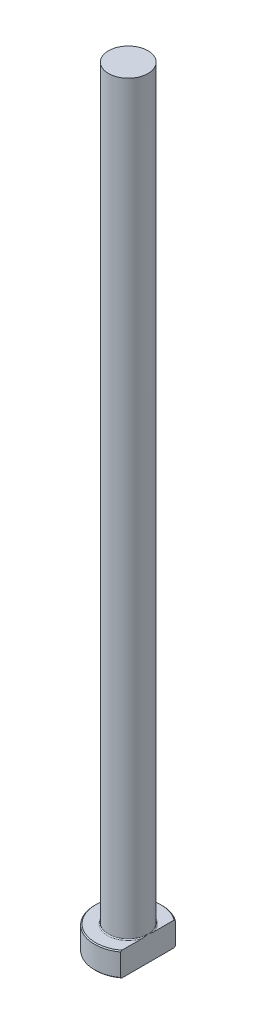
ISO-10303-21;
HEADER;
FILE_DESCRIPTION(('STEP AP214'),'2;1');
FILE_NAME('part.step','',(''),(''),'','','');
FILE_SCHEMA(('AUTOMOTIVE_DESIGN { 1 0 10303 214 1 1 1 1 }'));
ENDSEC;
DATA;
#1=APPLICATION_CONTEXT('core data for automotive mechanical design processes');
#2=APPLICATION_PROTOCOL_DEFINITION('international standard','automotive_design',2000,#1);
#3=PRODUCT_CONTEXT('',#1,'mechanical');
#4=PRODUCT('Part','Part','',(#3));
#5=PRODUCT_RELATED_PRODUCT_CATEGORY('part','',(#4));
#6=PRODUCT_DEFINITION_FORMATION('','',#4);
#7=PRODUCT_DEFINITION_CONTEXT('part definition',#1,'design');
#8=PRODUCT_DEFINITION('design','',#6,#7);
#9=PRODUCT_DEFINITION_SHAPE('','',#8);
#10=(LENGTH_UNIT() NAMED_UNIT(*) SI_UNIT(.MILLI.,.METRE.));
#11=(NAMED_UNIT(*) PLANE_ANGLE_UNIT() SI_UNIT($,.RADIAN.));
#12=(NAMED_UNIT(*) SI_UNIT($,.STERADIAN.) SOLID_ANGLE_UNIT());
#13=UNCERTAINTY_MEASURE_WITH_UNIT(LENGTH_MEASURE(1.E-05),#10,'distance_accuracy_value','');
#14=(GEOMETRIC_REPRESENTATION_CONTEXT(3) GLOBAL_UNCERTAINTY_ASSIGNED_CONTEXT((#13)) GLOBAL_UNIT_ASSIGNED_CONTEXT((#10,
#11,#12)) REPRESENTATION_CONTEXT('',''));
#15=CARTESIAN_POINT('',(0.,0.,0.));
#16=DIRECTION('',(0.,0.,1.));
#17=DIRECTION('',(1.,0.,0.));
#18=AXIS2_PLACEMENT_3D('',#15,#16,#17);
#19=CARTESIAN_POINT('',(0.,0.,0.));
#20=DIRECTION('',(0.,-1.,0.));
#21=DIRECTION('',(0.,0.,-1.));
#22=AXIS2_PLACEMENT_3D('',#19,#20,#21);
#23=PLANE('',#22);
#24=CARTESIAN_POINT('',(0.,0.,0.));
#25=DIRECTION('',(0.,-1.,0.));
#26=DIRECTION('',(0.,0.,-1.));
#27=AXIS2_PLACEMENT_3D('',#24,#25,#26);
#28=CIRCLE('',#27,6.79999999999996);
#29=CARTESIAN_POINT('',(4.09999999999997,0.,5.42494239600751));
#30=VERTEX_POINT('',#29);
#31=CARTESIAN_POINT('',(4.09999999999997,0.,-5.42494239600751));
#32=VERTEX_POINT('',#31);
#33=EDGE_CURVE('E98',#30,#32,#28,.T.);
#34=ORIENTED_EDGE('',*,*,#33,.T.);
#35=DIRECTION('',(0.,0.,1.));
#36=VECTOR('',#35,1.);
#37=CARTESIAN_POINT('',(4.09999999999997,0.,-5.6736231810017));
#38=LINE('',#37,#36);
#39=EDGE_CURVE('E83',#32,#30,#38,.T.);
#40=ORIENTED_EDGE('',*,*,#39,.T.);
#41=EDGE_LOOP('',(#34,#40));
#42=FACE_BOUND('',#41,.T.);
#43=ADVANCED_FACE('F32',(#42),#23,.T.);
#44=CARTESIAN_POINT('',(0.,259.958771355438,0.));
#45=DIRECTION('',(0.,1.,0.));
#46=DIRECTION('',(0.,0.,1.));
#47=AXIS2_PLACEMENT_3D('',#44,#45,#46);
#48=CYLINDRICAL_SURFACE('',#47,6.99999999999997);
#49=CARTESIAN_POINT('',(0.,4.80000000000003,0.));
#50=DIRECTION('',(0.,1.,0.));
#51=DIRECTION('',(0.,0.,1.));
#52=AXIS2_PLACEMENT_3D('',#49,#50,#51);
#53=CIRCLE('',#52,6.99999999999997);
#54=CARTESIAN_POINT('',(4.09999999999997,4.80000000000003,5.6736231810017));
#55=VERTEX_POINT('',#54);
#56=CARTESIAN_POINT('',(4.09999999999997,4.80000000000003,-5.6736231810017));
#57=VERTEX_POINT('',#56);
#58=EDGE_CURVE('E104',#55,#57,#53,.F.);
#59=ORIENTED_EDGE('',*,*,#58,.T.);
#60=DIRECTION('',(0.,-1.,0.));
#61=VECTOR('',#60,1.);
#62=CARTESIAN_POINT('',(4.09999999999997,160.,-5.6736231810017));
#63=LINE('',#62,#61);
#64=CARTESIAN_POINT('',(4.09999999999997,0.200000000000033,-5.6736231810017));
#65=VERTEX_POINT('',#64);
#66=EDGE_CURVE('E183',#57,#65,#63,.T.);
#67=ORIENTED_EDGE('',*,*,#66,.T.);
#68=CARTESIAN_POINT('',(0.,0.200000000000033,0.));
#69=DIRECTION('',(0.,-1.,0.));
#70=DIRECTION('',(0.,0.,-1.));
#71=AXIS2_PLACEMENT_3D('',#68,#69,#70);
#72=CIRCLE('',#71,6.99999999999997);
#73=CARTESIAN_POINT('',(4.09999999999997,0.200000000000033,5.6736231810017));
#74=VERTEX_POINT('',#73);
#75=EDGE_CURVE('E100',#65,#74,#72,.F.);
#76=ORIENTED_EDGE('',*,*,#75,.T.);
#77=DIRECTION('',(0.,-1.,0.));
#78=VECTOR('',#77,1.);
#79=CARTESIAN_POINT('',(4.09999999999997,160.,5.6736231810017));
#80=LINE('',#79,#78);
#81=EDGE_CURVE('E93',#55,#74,#80,.T.);
#82=ORIENTED_EDGE('',*,*,#81,.F.);
#83=EDGE_LOOP('',(#59,#67,#76,#82));
#84=FACE_BOUND('',#83,.T.);
#85=ADVANCED_FACE('F158',(#84),#48,.T.);
#86=CARTESIAN_POINT('',(-6.99999999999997,5.,0.));
#87=DIRECTION('',(0.,1.,0.));
#88=DIRECTION('',(0.,0.,1.));
#89=AXIS2_PLACEMENT_3D('',#86,#87,#88);
#90=PLANE('',#89);
#91=CARTESIAN_POINT('',(0.,5.,0.));
#92=DIRECTION('',(0.,1.,0.));
#93=DIRECTION('',(0.,0.,1.));
#94=AXIS2_PLACEMENT_3D('',#91,#92,#93);
#95=CIRCLE('',#94,6.80000000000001);
#96=CARTESIAN_POINT('',(4.09999999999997,5.,-5.42494239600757));
#97=VERTEX_POINT('',#96);
#98=CARTESIAN_POINT('',(4.09999999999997,5.,5.42494239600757));
#99=VERTEX_POINT('',#98);
#100=EDGE_CURVE('E178',#97,#99,#95,.T.);
#101=ORIENTED_EDGE('',*,*,#100,.T.);
#102=DIRECTION('',(0.,0.,-1.));
#103=VECTOR('',#102,1.);
#104=CARTESIAN_POINT('',(4.09999999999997,5.,0.));
#105=LINE('',#104,#103);
#106=CARTESIAN_POINT('',(4.09999999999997,4.99999999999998,1.29614813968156));
#107=VERTEX_POINT('',#106);
#108=EDGE_CURVE('E57',#99,#107,#105,.T.);
#109=ORIENTED_EDGE('',*,*,#108,.T.);
#110=CARTESIAN_POINT('',(0.,5.,0.));
#111=DIRECTION('',(0.,1.,0.));
#112=DIRECTION('',(0.,0.,1.));
#113=AXIS2_PLACEMENT_3D('',#110,#111,#112);
#114=CIRCLE('',#113,4.29999999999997);
#115=CARTESIAN_POINT('',(4.09999999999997,4.99999999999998,-1.29614813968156));
#116=VERTEX_POINT('',#115);
#117=EDGE_CURVE('E107',#107,#116,#114,.F.);
#118=ORIENTED_EDGE('',*,*,#117,.T.);
#119=EDGE_CURVE('E136',#116,#97,#105,.T.);
#120=ORIENTED_EDGE('',*,*,#119,.T.);
#121=EDGE_LOOP('',(#101,#109,#118,#120));
#122=FACE_BOUND('',#121,.T.);
#123=ADVANCED_FACE('F147',(#122),#90,.T.);
#124=CARTESIAN_POINT('',(0.,5.,0.));
#125=DIRECTION('',(0.,-1.,0.));
#126=DIRECTION('',(0.,0.,-1.));
#127=AXIS2_PLACEMENT_3D('',#124,#125,#126);
#128=CONICAL_SURFACE('',#127,6.8,0.785398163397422);
#129=ORIENTED_EDGE('',*,*,#58,.F.);
#130=CARTESIAN_POINT('',(4.09999999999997,-1.33929192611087,12.483228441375));
#131=CARTESIAN_POINT('',(4.09999999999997,-1.1369118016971,12.2702073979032));
#132=CARTESIAN_POINT('',(4.09999999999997,-0.934791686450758,12.0569390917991));
#133=CARTESIAN_POINT('',(4.09999999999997,-0.5311690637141,11.6298164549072));
#134=CARTESIAN_POINT('',(4.09999999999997,-0.32966656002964,11.4159621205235));
#135=CARTESIAN_POINT('',(4.09999999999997,0.273965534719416,10.7731725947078));
#136=CARTESIAN_POINT('',(4.09999999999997,0.6750171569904,10.3432236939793));
#137=CARTESIAN_POINT('',(4.09999999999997,1.47875431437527,9.47345436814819));
#138=CARTESIAN_POINT('',(4.09999999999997,1.88138218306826,9.03358046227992));
#139=CARTESIAN_POINT('',(4.09999999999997,2.48056970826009,8.36963259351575));
#140=CARTESIAN_POINT('',(4.09999999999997,2.67946853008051,8.14767042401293));
#141=CARTESIAN_POINT('',(4.09999999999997,3.07530374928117,7.70200314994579));
#142=CARTESIAN_POINT('',(4.09999999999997,3.27224016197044,7.47829805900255));
#143=CARTESIAN_POINT('',(4.09999999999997,3.62803580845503,7.06959504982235));
#144=CARTESIAN_POINT('',(4.09999999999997,3.7873068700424,6.88495594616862));
#145=CARTESIAN_POINT('',(4.09999999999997,4.10378434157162,6.51391771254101));
#146=CARTESIAN_POINT('',(4.09999999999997,4.26099077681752,6.32751860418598));
#147=CARTESIAN_POINT('',(4.09999999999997,4.57299335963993,5.95235210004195));
#148=CARTESIAN_POINT('',(4.09999999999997,4.72778657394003,5.7635822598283));
#149=CARTESIAN_POINT('',(4.09999999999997,5.03405385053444,5.38337519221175));
#150=CARTESIAN_POINT('',(4.09999999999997,5.18552806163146,5.191938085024));
#151=CARTESIAN_POINT('',(4.09999999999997,5.48381165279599,4.80616050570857));
#152=CARTESIAN_POINT('',(4.09999999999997,5.63063104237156,4.61182780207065));
#153=CARTESIAN_POINT('',(4.09999999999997,5.91857329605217,4.21889561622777));
#154=CARTESIAN_POINT('',(4.09999999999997,6.05969490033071,4.02029520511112));
#155=CARTESIAN_POINT('',(4.09999999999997,6.3338461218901,3.61807653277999));
#156=CARTESIAN_POINT('',(4.09999999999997,6.46688994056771,3.41446801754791));
#157=CARTESIAN_POINT('',(4.09999999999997,6.72196289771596,3.00051329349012));
#158=CARTESIAN_POINT('',(4.09999999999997,6.84399822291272,2.79017096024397));
#159=CARTESIAN_POINT('',(4.09999999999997,7.04294800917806,2.41613627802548));
#160=CARTESIAN_POINT('',(4.09999999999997,7.12340018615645,2.25434092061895));
#161=CARTESIAN_POINT('',(4.09999999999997,7.27278814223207,1.92538984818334));
#162=CARTESIAN_POINT('',(4.09999999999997,7.34172134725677,1.75823294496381));
#163=CARTESIAN_POINT('',(4.09999999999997,7.46395062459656,1.41984946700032));
#164=CARTESIAN_POINT('',(4.09999999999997,7.51737823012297,1.24867129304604));
#165=CARTESIAN_POINT('',(4.09999999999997,7.60539482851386,0.901532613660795));
#166=CARTESIAN_POINT('',(4.09999999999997,7.63999996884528,0.725576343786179));
#167=CARTESIAN_POINT('',(4.09999999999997,7.68036353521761,0.421086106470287));
#168=CARTESIAN_POINT('',(4.09999999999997,7.69152054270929,0.293260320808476));
#169=CARTESIAN_POINT('',(4.09999999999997,7.70182627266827,0.0371280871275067));
#170=CARTESIAN_POINT('',(4.09999999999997,7.70097696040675,-0.0911782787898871));
#171=CARTESIAN_POINT('',(4.09999999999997,7.68730446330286,-0.347367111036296));
#172=CARTESIAN_POINT('',(4.09999999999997,7.67446010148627,-0.475248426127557));
#173=CARTESIAN_POINT('',(4.09999999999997,7.63752967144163,-0.729373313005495));
#174=CARTESIAN_POINT('',(4.09999999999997,7.61344101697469,-0.855616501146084));
#175=CARTESIAN_POINT('',(4.09999999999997,7.54404317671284,-1.15392625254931));
#176=CARTESIAN_POINT('',(4.09999999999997,7.49413451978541,-1.32492035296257));
#177=CARTESIAN_POINT('',(4.09999999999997,7.37892989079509,-1.66161692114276));
#178=CARTESIAN_POINT('',(4.09999999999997,7.31362410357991,-1.827315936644));
#179=CARTESIAN_POINT('',(4.09999999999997,7.17079959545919,-2.15435858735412));
#180=CARTESIAN_POINT('',(4.09999999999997,7.09321727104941,-2.31567410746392));
#181=CARTESIAN_POINT('',(4.09999999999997,6.97004119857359,-2.55403843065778));
#182=CARTESIAN_POINT('',(4.09999999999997,6.92785402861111,-2.63288278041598));
#183=CARTESIAN_POINT('',(4.09999999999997,6.84148468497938,-2.7894692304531));
#184=CARTESIAN_POINT('',(4.09999999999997,6.79730258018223,-2.86721136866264));
#185=CARTESIAN_POINT('',(4.09999999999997,6.65934609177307,-3.10372248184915));
#186=CARTESIAN_POINT('',(4.09999999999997,6.56274427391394,-3.26084376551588));
#187=CARTESIAN_POINT('',(4.09999999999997,6.36389133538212,-3.57148434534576));
#188=CARTESIAN_POINT('',(4.09999999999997,6.2616389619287,-3.72500283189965));
#189=CARTESIAN_POINT('',(4.09999999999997,6.05267831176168,-4.02913378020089));
#190=CARTESIAN_POINT('',(4.09999999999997,5.94596678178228,-4.17974399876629));
#191=CARTESIAN_POINT('',(4.09999999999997,5.72908222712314,-4.47845767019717));
#192=CARTESIAN_POINT('',(4.09999999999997,5.61890895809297,-4.62656094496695));
#193=CARTESIAN_POINT('',(4.09999999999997,5.39553225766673,-4.92101937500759));
#194=CARTESIAN_POINT('',(4.09999999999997,5.28232219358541,-5.06736948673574));
#195=CARTESIAN_POINT('',(4.09999999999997,5.05364560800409,-5.35829836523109));
#196=CARTESIAN_POINT('',(4.09999999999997,4.93817902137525,-5.50287708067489));
#197=CARTESIAN_POINT('',(4.09999999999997,4.58900487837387,-5.93440610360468));
#198=CARTESIAN_POINT('',(4.09999999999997,4.3525403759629,-6.21912657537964));
#199=CARTESIAN_POINT('',(4.09999999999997,3.9936802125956,-6.6433615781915));
#200=CARTESIAN_POINT('',(4.09999999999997,3.87318866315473,-6.78450136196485));
#201=CARTESIAN_POINT('',(4.09999999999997,3.63111125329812,-7.06582575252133));
#202=CARTESIAN_POINT('',(4.09999999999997,3.50952545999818,-7.20601041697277));
#203=CARTESIAN_POINT('',(4.09999999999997,3.14334067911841,-7.62537642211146));
#204=CARTESIAN_POINT('',(4.09999999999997,2.89734299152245,-7.9033360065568));
#205=CARTESIAN_POINT('',(4.09999999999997,2.40293836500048,-8.45636150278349));
#206=CARTESIAN_POINT('',(4.09999999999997,2.15453550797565,-8.73143107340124));
#207=CARTESIAN_POINT('',(4.09999999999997,1.65560568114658,-9.27963529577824));
#208=CARTESIAN_POINT('',(4.09999999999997,1.40507871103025,-9.55276994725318));
#209=CARTESIAN_POINT('',(4.09999999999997,0.947239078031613,-10.0488717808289));
#210=CARTESIAN_POINT('',(4.09999999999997,0.740197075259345,-10.2720890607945));
#211=CARTESIAN_POINT('',(4.09999999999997,0.325116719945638,-10.7177199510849));
#212=CARTESIAN_POINT('',(4.09999999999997,0.117078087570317,-10.9401333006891));
#213=CARTESIAN_POINT('',(4.09999999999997,-0.29867490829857,-11.3830462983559));
#214=CARTESIAN_POINT('',(4.09999999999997,-0.506385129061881,-11.6035498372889));
#215=CARTESIAN_POINT('',(4.09999999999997,-0.922403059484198,-12.0438652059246));
#216=CARTESIAN_POINT('',(4.09999999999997,-1.13071056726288,-12.2636772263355));
#217=CARTESIAN_POINT('',(4.09999999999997,-1.33929192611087,-12.483228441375));
#218=B_SPLINE_CURVE_WITH_KNOTS('',3,(#130,#131,#132,#133,#134,#135,#136,#137,#138,#139,#140,
#141,#142,#143,#144,#145,#146,#147,#148,#149,#150,#151,#152,#153,#154,#155,#156,#157,#158,#159,
#160,#161,#162,#163,#164,#165,#166,#167,#168,#169,#170,#171,#172,#173,#174,#175,#176,#177,#178,
#179,#180,#181,#182,#183,#184,#185,#186,#187,#188,#189,#190,#191,#192,#193,#194,#195,#196,#197,
#198,#199,#200,#201,#202,#203,#204,#205,#206,#207,#208,#209,#210,#211,#212,#213,#214,#215,#216,
#217),.UNSPECIFIED.,.F.,.F.,(4,2,2,2,2,2,2,2,2,2,2,2,2,2,2,2,2,2,2,2,2,2,2,2,2,2,2,2,2,2,2,2,2,
2,2,2,2,2,2,2,2,2,2,4),(0.,0.881487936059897,1.76298129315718,3.52684938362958,5.3157643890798,
6.20987642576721,7.10398148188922,7.83549529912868,8.5670001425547,9.29933394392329,
10.0316348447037,10.7622363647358,11.4929985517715,12.2224363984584,12.9514617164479,
13.4932089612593,14.0350771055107,14.5722044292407,15.1088702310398,15.4932846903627,
15.8776362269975,16.2626676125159,16.6477876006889,17.1811942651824,17.7149418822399,
18.2515512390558,18.5197937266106,18.7880269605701,19.3411787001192,19.8944535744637,
20.4481394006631,21.0018643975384,21.5569172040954,22.1119860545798,23.2222096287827,
23.7789368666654,24.3356301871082,25.4491497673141,26.5610293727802,27.6729091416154,
28.5862688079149,29.4999020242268,30.4086844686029,31.3171893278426),.UNSPECIFIED.);
#219=EDGE_CURVE('E135',#55,#99,#218,.T.);
#220=ORIENTED_EDGE('',*,*,#219,.T.);
#221=ORIENTED_EDGE('',*,*,#100,.F.);
#222=EDGE_CURVE('E127',#97,#57,#218,.T.);
#223=ORIENTED_EDGE('',*,*,#222,.T.);
#224=EDGE_LOOP('',(#129,#220,#221,#223));
#225=FACE_BOUND('',#224,.T.);
#226=ADVANCED_FACE('F143',(#225),#128,.T.);
#227=CARTESIAN_POINT('',(0.,0.200000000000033,0.));
#228=DIRECTION('',(0.,1.,0.));
#229=DIRECTION('',(0.,0.,1.));
#230=AXIS2_PLACEMENT_3D('',#227,#228,#229);
#231=CONICAL_SURFACE('',#230,6.99999999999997,0.785398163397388);
#232=ORIENTED_EDGE('',*,*,#75,.F.);
#233=CARTESIAN_POINT('',(4.09999999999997,6.33929192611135,-12.483228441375));
#234=CARTESIAN_POINT('',(4.09999999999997,6.13691180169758,-12.2702073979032));
#235=CARTESIAN_POINT('',(4.09999999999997,5.93479168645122,-12.0569390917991));
#236=CARTESIAN_POINT('',(4.09999999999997,5.53116906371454,-11.6298164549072));
#237=CARTESIAN_POINT('',(4.09999999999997,5.32966656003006,-11.4159621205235));
#238=CARTESIAN_POINT('',(4.09999999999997,4.72603446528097,-10.7731725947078));
#239=CARTESIAN_POINT('',(4.09999999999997,4.32498284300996,-10.3432236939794));
#240=CARTESIAN_POINT('',(4.09999999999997,3.52124568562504,-9.47345436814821));
#241=CARTESIAN_POINT('',(4.09999999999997,3.11861781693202,-9.03358046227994));
#242=CARTESIAN_POINT('',(4.09999999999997,2.51943029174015,-8.36963259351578));
#243=CARTESIAN_POINT('',(4.09999999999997,2.32053146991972,-8.14767042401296));
#244=CARTESIAN_POINT('',(4.09999999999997,1.92469625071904,-7.70200314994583));
#245=CARTESIAN_POINT('',(4.09999999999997,1.72775983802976,-7.47829805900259));
#246=CARTESIAN_POINT('',(4.09999999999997,1.37196419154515,-7.0695950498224));
#247=CARTESIAN_POINT('',(4.09999999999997,1.21269312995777,-6.88495594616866));
#248=CARTESIAN_POINT('',(4.09999999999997,0.896215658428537,-6.51391771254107));
#249=CARTESIAN_POINT('',(4.09999999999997,0.739009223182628,-6.32751860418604));
#250=CARTESIAN_POINT('',(4.09999999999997,0.427006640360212,-5.95235210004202));
#251=CARTESIAN_POINT('',(4.09999999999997,0.272213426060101,-5.76358225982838));
#252=CARTESIAN_POINT('',(4.09999999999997,-0.0340538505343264,-5.38337519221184));
#253=CARTESIAN_POINT('',(4.09999999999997,-0.185528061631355,-5.1919380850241));
#254=CARTESIAN_POINT('',(4.09999999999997,-0.483811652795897,-4.80616050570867));
#255=CARTESIAN_POINT('',(4.09999999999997,-0.630631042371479,-4.61182780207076));
#256=CARTESIAN_POINT('',(4.09999999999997,-0.918573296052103,-4.21889561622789));
#257=CARTESIAN_POINT('',(4.09999999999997,-1.05969490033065,-4.02029520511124));
#258=CARTESIAN_POINT('',(4.09999999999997,-1.33384612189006,-3.61807653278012));
#259=CARTESIAN_POINT('',(4.09999999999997,-1.46688994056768,-3.41446801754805));
#260=CARTESIAN_POINT('',(4.09999999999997,-1.72196289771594,-3.00051329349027));
#261=CARTESIAN_POINT('',(4.09999999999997,-1.84399822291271,-2.79017096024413));
#262=CARTESIAN_POINT('',(4.09999999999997,-2.04294800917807,-2.41613627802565));
#263=CARTESIAN_POINT('',(4.09999999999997,-2.12340018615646,-2.25434092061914));
#264=CARTESIAN_POINT('',(4.09999999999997,-2.2727881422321,-1.92538984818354));
#265=CARTESIAN_POINT('',(4.09999999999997,-2.3417213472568,-1.75823294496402));
#266=CARTESIAN_POINT('',(4.09999999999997,-2.4639506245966,-1.41984946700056));
#267=CARTESIAN_POINT('',(4.09999999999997,-2.51737823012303,-1.24867129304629));
#268=CARTESIAN_POINT('',(4.09999999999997,-2.60539482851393,-0.901532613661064));
#269=CARTESIAN_POINT('',(4.09999999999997,-2.63999996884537,-0.725576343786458));
#270=CARTESIAN_POINT('',(4.09999999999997,-2.68036353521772,-0.42108610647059));
#271=CARTESIAN_POINT('',(4.09999999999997,-2.69152054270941,-0.293260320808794));
#272=CARTESIAN_POINT('',(4.09999999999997,-2.70182627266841,-0.0371280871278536));
#273=CARTESIAN_POINT('',(4.09999999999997,-2.7009769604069,0.0911782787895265));
#274=CARTESIAN_POINT('',(4.09999999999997,-2.68730446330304,0.347367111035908));
#275=CARTESIAN_POINT('',(4.09999999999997,-2.67446010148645,0.475248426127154));
#276=CARTESIAN_POINT('',(4.09999999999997,-2.63752967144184,0.729373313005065));
#277=CARTESIAN_POINT('',(4.09999999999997,-2.61344101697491,0.855616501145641));
#278=CARTESIAN_POINT('',(4.09999999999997,-2.54404317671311,1.15392625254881));
#279=CARTESIAN_POINT('',(4.09999999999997,-2.4941345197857,1.32492035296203));
#280=CARTESIAN_POINT('',(4.09999999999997,-2.37892989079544,1.66161692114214));
#281=CARTESIAN_POINT('',(4.09999999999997,-2.31362410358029,1.82731593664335));
#282=CARTESIAN_POINT('',(4.09999999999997,-2.17079959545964,2.15435858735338));
#283=CARTESIAN_POINT('',(4.09999999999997,-2.09321727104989,2.31567410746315));
#284=CARTESIAN_POINT('',(4.09999999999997,-1.97004119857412,2.55403843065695));
#285=CARTESIAN_POINT('',(4.09999999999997,-1.92785402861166,2.63288278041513));
#286=CARTESIAN_POINT('',(4.09999999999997,-1.84148468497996,2.78946923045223));
#287=CARTESIAN_POINT('',(4.09999999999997,-1.79730258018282,2.86721136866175));
#288=CARTESIAN_POINT('',(4.09999999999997,-1.65934609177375,3.10372248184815));
#289=CARTESIAN_POINT('',(4.09999999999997,-1.56274427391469,3.26084376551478));
#290=CARTESIAN_POINT('',(4.09999999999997,-1.36389133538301,3.57148434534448));
#291=CARTESIAN_POINT('',(4.09999999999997,-1.26163896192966,3.72500283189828));
#292=CARTESIAN_POINT('',(4.09999999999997,-1.05267831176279,4.02913378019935));
#293=CARTESIAN_POINT('',(4.09999999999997,-0.945966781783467,4.17974399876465));
#294=CARTESIAN_POINT('',(4.09999999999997,-0.72908222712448,4.47845767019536));
#295=CARTESIAN_POINT('',(4.09999999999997,-0.61890895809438,4.62656094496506));
#296=CARTESIAN_POINT('',(4.09999999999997,-0.395532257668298,4.92101937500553));
#297=CARTESIAN_POINT('',(4.09999999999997,-0.282322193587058,5.06736948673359));
#298=CARTESIAN_POINT('',(4.09999999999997,-0.0536456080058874,5.35829836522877));
#299=CARTESIAN_POINT('',(4.09999999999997,0.0618209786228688,5.50287708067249));
#300=CARTESIAN_POINT('',(4.09999999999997,0.410995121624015,5.93440610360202));
#301=CARTESIAN_POINT('',(4.09999999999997,0.647459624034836,6.21912657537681));
#302=CARTESIAN_POINT('',(4.09999999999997,1.0063197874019,6.64336157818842));
#303=CARTESIAN_POINT('',(4.09999999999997,1.12681133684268,6.78450136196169));
#304=CARTESIAN_POINT('',(4.09999999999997,1.36888874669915,7.065825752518));
#305=CARTESIAN_POINT('',(4.09999999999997,1.490474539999,7.20601041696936));
#306=CARTESIAN_POINT('',(4.09999999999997,1.85665932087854,7.6253764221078));
#307=CARTESIAN_POINT('',(4.09999999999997,2.10265700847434,7.90333600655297));
#308=CARTESIAN_POINT('',(4.09999999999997,2.597061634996,8.45636150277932));
#309=CARTESIAN_POINT('',(4.09999999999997,2.84546449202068,8.73143107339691));
#310=CARTESIAN_POINT('',(4.09999999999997,3.34439431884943,9.27963529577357));
#311=CARTESIAN_POINT('',(4.09999999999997,3.5949212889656,9.55276994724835));
#312=CARTESIAN_POINT('',(4.09999999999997,4.05276092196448,10.0488717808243));
#313=CARTESIAN_POINT('',(4.09999999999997,4.25980292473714,10.2720890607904));
#314=CARTESIAN_POINT('',(4.09999999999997,4.67488328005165,10.7177199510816));
#315=CARTESIAN_POINT('',(4.09999999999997,4.88292191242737,10.9401333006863));
#316=CARTESIAN_POINT('',(4.09999999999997,5.29867490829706,11.3830462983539));
#317=CARTESIAN_POINT('',(4.09999999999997,5.50638512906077,11.6035498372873));
#318=CARTESIAN_POINT('',(4.09999999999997,5.92240305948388,12.0438652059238));
#319=CARTESIAN_POINT('',(4.09999999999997,6.13071056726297,12.2636772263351));
#320=CARTESIAN_POINT('',(4.09999999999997,6.33929192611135,12.483228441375));
#321=B_SPLINE_CURVE_WITH_KNOTS('',3,(#233,#234,#235,#236,#237,#238,#239,#240,#241,#242,#243,
#244,#245,#246,#247,#248,#249,#250,#251,#252,#253,#254,#255,#256,#257,#258,#259,#260,#261,#262,
#263,#264,#265,#266,#267,#268,#269,#270,#271,#272,#273,#274,#275,#276,#277,#278,#279,#280,#281,
#282,#283,#284,#285,#286,#287,#288,#289,#290,#291,#292,#293,#294,#295,#296,#297,#298,#299,#300,
#301,#302,#303,#304,#305,#306,#307,#308,#309,#310,#311,#312,#313,#314,#315,#316,#317,#318,#319,
#320),.UNSPECIFIED.,.F.,.F.,(4,2,2,2,2,2,2,2,2,2,2,2,2,2,2,2,2,2,2,2,2,2,2,2,2,2,2,2,2,2,2,2,2,
2,2,2,2,2,2,2,2,2,2,4),(0.,0.88148793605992,1.76298129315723,3.52684938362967,5.31576438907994,
6.20987642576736,7.1039814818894,7.83549529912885,8.56700014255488,9.29933394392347,
10.0316348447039,10.7622363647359,11.4929985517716,12.2224363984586,12.9514617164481,
13.4932089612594,14.0350771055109,14.5722044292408,15.1088702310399,15.4932846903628,
15.8776362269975,16.2626676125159,16.6477876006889,17.1811942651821,17.7149418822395,
18.2515512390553,18.5197937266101,18.7880269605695,19.3411787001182,19.8944535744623,
20.4481394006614,21.0018643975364,21.5569172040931,22.1119860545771,23.2222096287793,
23.7789368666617,24.3356301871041,25.4491497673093,26.5610293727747,27.6729091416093,
28.5862688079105,29.4999020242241,30.408684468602,31.3171893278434),.UNSPECIFIED.);
#322=EDGE_CURVE('E86',#65,#32,#321,.T.);
#323=ORIENTED_EDGE('',*,*,#322,.T.);
#324=ORIENTED_EDGE('',*,*,#33,.F.);
#325=EDGE_CURVE('E89',#30,#74,#321,.T.);
#326=ORIENTED_EDGE('',*,*,#325,.T.);
#327=EDGE_LOOP('',(#232,#323,#324,#326));
#328=FACE_BOUND('',#327,.T.);
#329=ADVANCED_FACE('F97',(#328),#231,.T.);
#330=CARTESIAN_POINT('',(0.,5.19999999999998,0.));
#331=DIRECTION('',(0.,1.,0.));
#332=DIRECTION('',(0.,0.,1.));
#333=AXIS2_PLACEMENT_3D('',#330,#331,#332);
#334=TOROIDAL_SURFACE('',#333,4.29999999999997,0.2);
#335=CARTESIAN_POINT('',(4.09999999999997,5.19999999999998,0.));
#336=CARTESIAN_POINT('',(4.09999999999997,5.20000051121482,8.48177579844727E-11));
#337=CARTESIAN_POINT('',(4.09999999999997,5.2000010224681,-2.37341874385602E-07));
#338=CARTESIAN_POINT('',(4.09999999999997,5.20000197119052,-8.69991321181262E-07));
#339=CARTESIAN_POINT('',(4.09999999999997,5.20000238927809,-1.28223494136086E-06));
#340=CARTESIAN_POINT('',(4.09999999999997,5.20000327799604,-2.27653388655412E-06));
#341=CARTESIAN_POINT('',(4.09999999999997,5.20000373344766,-2.87471299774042E-06));
#342=CARTESIAN_POINT('',(4.09999999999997,5.20000453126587,-4.09830357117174E-06));
#343=CARTESIAN_POINT('',(4.09999999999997,5.20000487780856,-4.72126748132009E-06));
#344=CARTESIAN_POINT('',(4.09999999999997,5.20000620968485,-7.19543436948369E-06));
#345=CARTESIAN_POINT('',(4.09999999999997,5.20000713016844,-9.08507628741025E-06));
#346=CARTESIAN_POINT('',(4.09999999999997,5.20000860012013,-1.27786167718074E-05));
#347=CARTESIAN_POINT('',(4.09999999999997,5.2000091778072,-1.45716794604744E-05));
#348=CARTESIAN_POINT('',(4.09999999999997,5.20001167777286,-2.23278313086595E-05));
#349=CARTESIAN_POINT('',(4.09999999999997,5.20001360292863,-2.82919348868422E-05));
#350=CARTESIAN_POINT('',(4.09999999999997,5.20001636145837,-3.94393207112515E-05));
#351=CARTESIAN_POINT('',(4.09999999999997,5.20001732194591,-4.459065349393E-05));
#352=CARTESIAN_POINT('',(4.09999999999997,5.20002443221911,-8.33481274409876E-05));
#353=CARTESIAN_POINT('',(4.09999999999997,5.20002995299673,-0.000117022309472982));
#354=CARTESIAN_POINT('',(4.09999999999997,5.20005411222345,-0.000250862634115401));
#355=CARTESIAN_POINT('',(4.09999999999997,5.20007702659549,-0.000350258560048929));
#356=CARTESIAN_POINT('',(4.09999999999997,5.20016686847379,-0.000745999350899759));
#357=CARTESIAN_POINT('',(4.09999999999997,5.20023113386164,-0.00104273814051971));
#358=CARTESIAN_POINT('',(4.09999999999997,5.20048975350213,-0.00222871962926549));
#359=CARTESIAN_POINT('',(4.09999999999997,5.20068752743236,-0.00311743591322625));
#360=CARTESIAN_POINT('',(4.09999999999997,5.20151360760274,-0.00683863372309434));
#361=CARTESIAN_POINT('',(4.09999999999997,5.20213761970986,-0.00967177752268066));
#362=CARTESIAN_POINT('',(4.09999999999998,5.21060513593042,-0.0481053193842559));
#363=CARTESIAN_POINT('',(4.09999999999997,5.21847514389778,-0.0837019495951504));
#364=CARTESIAN_POINT('',(4.09999999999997,5.23497753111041,-0.15888321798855));
#365=CARTESIAN_POINT('',(4.09999999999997,5.24359721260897,-0.198470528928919));
#366=CARTESIAN_POINT('',(4.09999999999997,5.25810552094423,-0.266014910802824));
#367=CARTESIAN_POINT('',(4.09999999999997,5.26405008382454,-0.293959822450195));
#368=CARTESIAN_POINT('',(4.09999999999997,5.27562355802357,-0.34912552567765));
#369=CARTESIAN_POINT('',(4.09999999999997,5.28125665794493,-0.376345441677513));
#370=CARTESIAN_POINT('',(4.09999999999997,5.29943979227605,-0.46575599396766));
#371=CARTESIAN_POINT('',(4.09999999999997,5.31159607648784,-0.528028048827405));
#372=CARTESIAN_POINT('',(4.09999999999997,5.3345183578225,-0.653452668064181));
#373=CARTESIAN_POINT('',(4.09999999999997,5.34526982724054,-0.716607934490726));
#374=CARTESIAN_POINT('',(4.09999999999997,5.36549989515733,-0.849208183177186));
#375=CARTESIAN_POINT('',(4.09999999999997,5.37476398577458,-0.918686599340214));
#376=CARTESIAN_POINT('',(4.09999999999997,5.38955225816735,-1.05786044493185));
#377=CARTESIAN_POINT('',(4.09999999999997,5.39508786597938,-1.12755454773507));
#378=CARTESIAN_POINT('',(4.09999999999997,5.3992964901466,-1.23112590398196));
#379=CARTESIAN_POINT('',(4.09999999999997,5.40003705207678,-1.26491756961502));
#380=CARTESIAN_POINT('',(4.09999999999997,5.39995996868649,-1.33249559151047));
#381=CARTESIAN_POINT('',(4.09999999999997,5.39914270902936,-1.36628194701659));
#382=CARTESIAN_POINT('',(4.09999999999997,5.39557880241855,-1.43339843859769));
#383=CARTESIAN_POINT('',(4.09999999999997,5.39285312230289,-1.46672955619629));
#384=CARTESIAN_POINT('',(4.09999999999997,5.3849220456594,-1.53304911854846));
#385=CARTESIAN_POINT('',(4.09999999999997,5.37972044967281,-1.56603800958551));
#386=CARTESIAN_POINT('',(4.09999999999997,5.36576321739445,-1.63210333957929));
#387=CARTESIAN_POINT('',(4.09999999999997,5.35693238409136,-1.66516593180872));
#388=CARTESIAN_POINT('',(4.09999999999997,5.33956496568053,-1.71313701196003));
#389=CARTESIAN_POINT('',(4.09999999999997,5.33312382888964,-1.72879572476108));
#390=CARTESIAN_POINT('',(4.09999999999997,5.31841020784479,-1.75921181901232));
#391=CARTESIAN_POINT('',(4.09999999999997,5.31014484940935,-1.77397243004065));
#392=CARTESIAN_POINT('',(4.09999999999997,5.29597609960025,-1.79459137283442));
#393=CARTESIAN_POINT('',(4.09999999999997,5.29105059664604,-1.80111732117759));
#394=CARTESIAN_POINT('',(4.09999999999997,5.28047159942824,-1.81356806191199));
#395=CARTESIAN_POINT('',(4.09999999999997,5.27481806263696,-1.81949281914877));
#396=CARTESIAN_POINT('',(4.09999999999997,5.26378662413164,-1.82942177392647));
#397=CARTESIAN_POINT('',(4.09999999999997,5.25854825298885,-1.83357893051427));
#398=CARTESIAN_POINT('',(4.09999999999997,5.24747881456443,-1.8410175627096));
#399=CARTESIAN_POINT('',(4.09999999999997,5.24164898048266,-1.84430081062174));
#400=CARTESIAN_POINT('',(4.09999999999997,5.23103019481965,-1.84897077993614));
#401=CARTESIAN_POINT('',(4.09999999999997,5.22636142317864,-1.85062832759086));
#402=CARTESIAN_POINT('',(4.09999999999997,5.21681344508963,-1.85314556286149));
#403=CARTESIAN_POINT('',(4.09999999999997,5.21193447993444,-1.85400614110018));
#404=CARTESIAN_POINT('',(4.09999999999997,5.2020790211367,-1.8548454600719));
#405=CARTESIAN_POINT('',(4.09999999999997,5.19710220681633,-1.85482052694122));
#406=CARTESIAN_POINT('',(4.09999999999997,5.18723254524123,-1.85388227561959));
#407=CARTESIAN_POINT('',(4.09999999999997,5.18233974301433,-1.8529684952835));
#408=CARTESIAN_POINT('',(4.09999999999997,5.17301169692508,-1.85041011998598));
#409=CARTESIAN_POINT('',(4.09999999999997,5.16856577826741,-1.84880345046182));
#410=CARTESIAN_POINT('',(4.09999999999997,5.15994310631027,-1.84499014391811));
#411=CARTESIAN_POINT('',(4.09999999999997,5.15576643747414,-1.84278331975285));
#412=CARTESIAN_POINT('',(4.09999999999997,5.1448604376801,-1.83616140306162));
#413=CARTESIAN_POINT('',(4.09999999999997,5.13841060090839,-1.8312871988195));
#414=CARTESIAN_POINT('',(4.09999999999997,5.12632402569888,-1.82061430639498));
#415=CARTESIAN_POINT('',(4.09999999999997,5.12069027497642,-1.81481237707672));
#416=CARTESIAN_POINT('',(4.09999999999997,5.10569835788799,-1.79748307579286));
#417=CARTESIAN_POINT('',(4.09999999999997,5.0971810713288,-1.78523612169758));
#418=CARTESIAN_POINT('',(4.09999999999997,5.08190874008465,-1.759730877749));
#419=CARTESIAN_POINT('',(4.09999999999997,5.07515617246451,-1.74647119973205));
#420=CARTESIAN_POINT('',(4.09999999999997,5.06057670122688,-1.71404296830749));
#421=CARTESIAN_POINT('',(4.09999999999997,5.05336936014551,-1.69459894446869));
#422=CARTESIAN_POINT('',(4.09999999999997,5.04078670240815,-1.65511361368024));
#423=CARTESIAN_POINT('',(4.09999999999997,5.03541518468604,-1.63507116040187));
#424=CARTESIAN_POINT('',(4.09999999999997,5.02602669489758,-1.59438056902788));
#425=CARTESIAN_POINT('',(4.09999999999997,5.02202979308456,-1.57372787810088));
#426=CARTESIAN_POINT('',(4.09999999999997,5.01520764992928,-1.53226128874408));
#427=CARTESIAN_POINT('',(4.09999999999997,5.01238102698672,-1.51144761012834));
#428=CARTESIAN_POINT('',(4.09999999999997,5.00618826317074,-1.45642510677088));
#429=CARTESIAN_POINT('',(4.09999999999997,5.00362476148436,-1.42212636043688));
#430=CARTESIAN_POINT('',(4.09999999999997,5.00045800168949,-1.35343324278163));
#431=CARTESIAN_POINT('',(4.09999999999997,4.99985588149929,-1.31903882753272));
#432=CARTESIAN_POINT('',(4.09999999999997,5.00037893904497,-1.21560964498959));
#433=CARTESIAN_POINT('',(4.09999999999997,5.00385566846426,-1.14658832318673));
#434=CARTESIAN_POINT('',(4.09999999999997,5.01464295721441,-1.01357004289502));
#435=CARTESIAN_POINT('',(4.09999999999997,5.02167983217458,-0.949547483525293));
#436=CARTESIAN_POINT('',(4.09999999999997,5.03833051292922,-0.822416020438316));
#437=CARTESIAN_POINT('',(4.09999999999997,5.04792112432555,-0.759304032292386));
#438=CARTESIAN_POINT('',(4.09999999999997,5.06649836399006,-0.648156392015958));
#439=CARTESIAN_POINT('',(4.09999999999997,5.07509963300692,-0.60005440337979));
#440=CARTESIAN_POINT('',(4.09999999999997,5.09336865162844,-0.5027171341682));
#441=CARTESIAN_POINT('',(4.09999999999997,5.10305882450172,-0.45348607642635));
#442=CARTESIAN_POINT('',(4.09999999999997,5.12010265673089,-0.369650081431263));
#443=CARTESIAN_POINT('',(4.09999999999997,5.1273025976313,-0.335013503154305));
#444=CARTESIAN_POINT('',(4.09999999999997,5.14184386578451,-0.26617579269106));
#445=CARTESIAN_POINT('',(4.09999999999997,5.14918270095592,-0.231974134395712));
#446=CARTESIAN_POINT('',(4.09999999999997,5.16314314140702,-0.167541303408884));
#447=CARTESIAN_POINT('',(4.09999999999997,5.16974991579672,-0.137306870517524));
#448=CARTESIAN_POINT('',(4.09999999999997,5.18332308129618,-0.0755506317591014));
#449=CARTESIAN_POINT('',(4.09999999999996,5.19029270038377,-0.0440294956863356));
#450=CARTESIAN_POINT('',(4.09999999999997,5.19786353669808,-0.00966658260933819));
#451=CARTESIAN_POINT('',(4.09999999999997,5.19848867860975,-0.00682823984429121));
#452=CARTESIAN_POINT('',(4.09999999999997,5.19931502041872,-0.00310588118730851));
#453=CARTESIAN_POINT('',(4.09999999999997,5.19951189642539,-0.00222119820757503));
#454=CARTESIAN_POINT('',(4.09999999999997,5.19976942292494,-0.00104022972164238));
#455=CARTESIAN_POINT('',(4.09999999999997,5.19983347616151,-0.000744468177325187));
#456=CARTESIAN_POINT('',(4.09999999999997,5.19992306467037,-0.000349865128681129));
#457=CARTESIAN_POINT('',(4.09999999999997,5.1999459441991,-0.000250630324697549));
#458=CARTESIAN_POINT('',(4.09999999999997,5.19997007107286,-0.000116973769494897));
#459=CARTESIAN_POINT('',(4.09999999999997,5.19997558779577,-8.33211280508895E-05));
#460=CARTESIAN_POINT('',(4.09999999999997,5.19998268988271,-4.45857715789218E-05));
#461=CARTESIAN_POINT('',(4.09999999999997,5.19998364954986,-3.94355404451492E-05));
#462=CARTESIAN_POINT('',(4.09999999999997,5.19998640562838,-2.82904942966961E-05));
#463=CARTESIAN_POINT('',(4.09999999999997,5.19998832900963,-2.23275713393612E-05));
#464=CARTESIAN_POINT('',(4.09999999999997,5.19999082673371,-1.45726655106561E-05));
#465=CARTESIAN_POINT('',(4.09999999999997,5.19999140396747,-1.27796833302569E-05));
#466=CARTESIAN_POINT('',(4.09999999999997,5.19999287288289,-9.08623741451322E-06));
#467=CARTESIAN_POINT('',(4.09999999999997,5.19999379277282,-7.19659802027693E-06));
#468=CARTESIAN_POINT('',(4.09999999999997,5.19999512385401,-4.72235852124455E-06));
#469=CARTESIAN_POINT('',(4.09999999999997,5.1999954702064,-4.0993503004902E-06));
#470=CARTESIAN_POINT('',(4.09999999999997,5.19999626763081,-2.87563677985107E-06));
#471=CARTESIAN_POINT('',(4.09999999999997,5.19999672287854,-2.2773772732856E-06));
#472=CARTESIAN_POINT('',(4.09999999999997,5.19999761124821,-1.28289389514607E-06));
#473=CARTESIAN_POINT('',(4.09999999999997,5.19999802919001,-8.70554048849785E-07));
#474=CARTESIAN_POINT('',(4.09999999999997,5.19999897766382,-2.3765555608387E-07));
#475=CARTESIAN_POINT('',(4.09999999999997,5.19999948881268,-8.48131903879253E-11));
#476=CARTESIAN_POINT('',(4.09999999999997,5.19999999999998,0.));
#477=B_SPLINE_CURVE_WITH_KNOTS('',3,(#335,#336,#337,#338,#339,#340,#341,#342,#343,#344,#345,
#346,#347,#348,#349,#350,#351,#352,#353,#354,#355,#356,#357,#358,#359,#360,#361,#362,#363,#364,
#365,#366,#367,#368,#369,#370,#371,#372,#373,#374,#375,#376,#377,#378,#379,#380,#381,#382,#383,
#384,#385,#386,#387,#388,#389,#390,#391,#392,#393,#394,#395,#396,#397,#398,#399,#400,#401,#402,
#403,#404,#405,#406,#407,#408,#409,#410,#411,#412,#413,#414,#415,#416,#417,#418,#419,#420,#421,
#422,#423,#424,#425,#426,#427,#428,#429,#430,#431,#432,#433,#434,#435,#436,#437,#438,#439,#440,
#441,#442,#443,#444,#445,#446,#447,#448,#449,#450,#451,#452,#453,#454,#455,#456,#457,#458,#459,
#460,#461,#462,#463,#464,#465,#466,#467,#468,#469,#470,#471,#472,#473,#474,#475,#476),
.UNSPECIFIED.,.T.,.F.,(4,2,2,2,2,2,2,2,2,2,2,2,2,2,2,2,2,2,2,2,2,2,2,2,2,2,2,2,2,2,2,2,2,2,2,2,
2,2,2,2,2,2,2,2,2,2,2,2,2,2,2,2,2,2,2,2,2,2,2,2,2,2,2,2,2,2,2,2,2,2,4),(0.,1.56077961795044E-06,
3.3330233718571E-06,5.57220089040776E-06,7.71031786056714E-06,1.39959462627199E-05,
1.96420817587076E-05,3.84177478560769E-05,5.41207073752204E-05,0.000156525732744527,
0.000462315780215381,0.00137340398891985,0.00410448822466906,0.0128079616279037,
0.122174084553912,0.243719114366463,0.329429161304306,0.41281904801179,0.603149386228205,
0.795314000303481,1.0055338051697,1.21510641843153,1.31647802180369,1.41782453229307,
1.51807472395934,1.61817152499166,1.72045618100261,1.77118252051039,1.82171411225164,
1.84620451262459,1.87069634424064,1.89069743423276,1.91065764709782,1.92546132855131,
1.94024844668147,1.9550969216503,1.96995312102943,1.98408278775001,1.99821686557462,
2.02232905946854,2.04652741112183,2.09102796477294,2.13559065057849,2.19765435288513,
2.25984571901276,2.32290998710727,2.38589958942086,2.489000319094,2.59216085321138,
2.79925959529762,2.99242441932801,3.18389136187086,3.33047882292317,3.48099951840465,
3.58712985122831,3.69206963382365,3.78491369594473,3.88175875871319,3.89047819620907,
3.89319688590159,3.89410497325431,3.89441026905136,3.8945126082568,3.89452830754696,
3.8945470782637,3.89455272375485,3.89455900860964,3.89456114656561,3.89456338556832,
3.8945651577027,3.89456671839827),.UNSPECIFIED.);
#478=CARTESIAN_POINT('',(4.09999999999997,5.19999999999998,0.));
#479=VERTEX_POINT('',#478);
#480=EDGE_CURVE('E11',#116,#479,#477,.T.);
#481=ORIENTED_EDGE('',*,*,#480,.F.);
#482=ORIENTED_EDGE('',*,*,#117,.F.);
#483=CARTESIAN_POINT('',(4.09999999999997,5.19999999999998,0.));
#484=CARTESIAN_POINT('',(4.09999999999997,5.19999948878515,-8.48181322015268E-11));
#485=CARTESIAN_POINT('',(4.09999999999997,5.19999897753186,2.37341874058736E-07));
#486=CARTESIAN_POINT('',(4.09999999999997,5.19999802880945,8.69991321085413E-07));
#487=CARTESIAN_POINT('',(4.09999999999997,5.19999761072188,1.28223494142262E-06));
#488=CARTESIAN_POINT('',(4.09999999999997,5.19999672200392,2.27653388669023E-06));
#489=CARTESIAN_POINT('',(4.09999999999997,5.1999962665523,2.874712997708E-06));
#490=CARTESIAN_POINT('',(4.09999999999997,5.19999546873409,4.0983035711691E-06));
#491=CARTESIAN_POINT('',(4.09999999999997,5.1999951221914,4.72126748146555E-06));
#492=CARTESIAN_POINT('',(4.09999999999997,5.19999379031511,7.19543437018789E-06));
#493=CARTESIAN_POINT('',(4.09999999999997,5.19999286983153,9.0850762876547E-06));
#494=CARTESIAN_POINT('',(4.09999999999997,5.19999139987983,1.27786167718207E-05));
#495=CARTESIAN_POINT('',(4.09999999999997,5.19999082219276,1.45716794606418E-05));
#496=CARTESIAN_POINT('',(4.09999999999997,5.1999883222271,2.2327831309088E-05));
#497=CARTESIAN_POINT('',(4.09999999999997,5.19998639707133,2.82919348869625E-05));
#498=CARTESIAN_POINT('',(4.09999999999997,5.19998363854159,3.94393207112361E-05));
#499=CARTESIAN_POINT('',(4.09999999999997,5.19998267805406,4.45906534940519E-05));
#500=CARTESIAN_POINT('',(4.09999999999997,5.19997556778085,8.33481274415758E-05));
#501=CARTESIAN_POINT('',(4.09999999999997,5.19997004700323,0.000117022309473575));
#502=CARTESIAN_POINT('',(4.09999999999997,5.19994588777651,0.000250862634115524));
#503=CARTESIAN_POINT('',(4.09999999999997,5.19992297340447,0.000350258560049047));
#504=CARTESIAN_POINT('',(4.09999999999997,5.19983313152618,0.000745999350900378));
#505=CARTESIAN_POINT('',(4.09999999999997,5.19976886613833,0.00104273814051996));
#506=CARTESIAN_POINT('',(4.09999999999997,5.19951024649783,0.00222871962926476));
#507=CARTESIAN_POINT('',(4.09999999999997,5.1993124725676,0.00311743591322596));
#508=CARTESIAN_POINT('',(4.09999999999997,5.19848639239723,0.00683863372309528));
#509=CARTESIAN_POINT('',(4.09999999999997,5.19786238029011,0.0096717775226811));
#510=CARTESIAN_POINT('',(4.09999999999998,5.18939486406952,0.0481053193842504));
#511=CARTESIAN_POINT('',(4.09999999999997,5.18152485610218,0.0837019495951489));
#512=CARTESIAN_POINT('',(4.09999999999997,5.16502246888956,0.158883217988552));
#513=CARTESIAN_POINT('',(4.09999999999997,5.156402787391,0.19847052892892));
#514=CARTESIAN_POINT('',(4.09999999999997,5.14189447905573,0.266014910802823));
#515=CARTESIAN_POINT('',(4.09999999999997,5.13594991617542,0.293959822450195));
#516=CARTESIAN_POINT('',(4.09999999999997,5.12437644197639,0.34912552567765));
#517=CARTESIAN_POINT('',(4.09999999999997,5.11874334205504,0.376345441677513));
#518=CARTESIAN_POINT('',(4.09999999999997,5.10056020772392,0.46575599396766));
#519=CARTESIAN_POINT('',(4.09999999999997,5.08840392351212,0.528028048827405));
#520=CARTESIAN_POINT('',(4.09999999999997,5.06548164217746,0.65345266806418));
#521=CARTESIAN_POINT('',(4.09999999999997,5.05473017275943,0.716607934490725));
#522=CARTESIAN_POINT('',(4.09999999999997,5.03450010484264,0.849208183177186));
#523=CARTESIAN_POINT('',(4.09999999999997,5.02523601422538,0.918686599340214));
#524=CARTESIAN_POINT('',(4.09999999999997,5.01044774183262,1.05786044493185));
#525=CARTESIAN_POINT('',(4.09999999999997,5.00491213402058,1.12755454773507));
#526=CARTESIAN_POINT('',(4.09999999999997,5.00070350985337,1.23112590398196));
#527=CARTESIAN_POINT('',(4.09999999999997,4.99996294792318,1.26491756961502));
#528=CARTESIAN_POINT('',(4.09999999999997,5.00004003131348,1.33249559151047));
#529=CARTESIAN_POINT('',(4.09999999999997,5.00085729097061,1.36628194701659));
#530=CARTESIAN_POINT('',(4.09999999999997,5.00442119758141,1.43339843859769));
#531=CARTESIAN_POINT('',(4.09999999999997,5.00714687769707,1.46672955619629));
#532=CARTESIAN_POINT('',(4.09999999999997,5.01507795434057,1.53304911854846));
#533=CARTESIAN_POINT('',(4.09999999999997,5.02027955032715,1.56603800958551));
#534=CARTESIAN_POINT('',(4.09999999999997,5.03423678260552,1.63210333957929));
#535=CARTESIAN_POINT('',(4.09999999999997,5.04306761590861,1.66516593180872));
#536=CARTESIAN_POINT('',(4.09999999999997,5.06043503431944,1.71313701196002));
#537=CARTESIAN_POINT('',(4.09999999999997,5.06687617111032,1.72879572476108));
#538=CARTESIAN_POINT('',(4.09999999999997,5.08158979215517,1.75921181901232));
#539=CARTESIAN_POINT('',(4.09999999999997,5.08985515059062,1.77397243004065));
#540=CARTESIAN_POINT('',(4.09999999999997,5.10402390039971,1.79459137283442));
#541=CARTESIAN_POINT('',(4.09999999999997,5.10894940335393,1.8011173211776));
#542=CARTESIAN_POINT('',(4.09999999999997,5.11952840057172,1.81356806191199));
#543=CARTESIAN_POINT('',(4.09999999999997,5.12518193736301,1.81949281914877));
#544=CARTESIAN_POINT('',(4.09999999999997,5.13621337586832,1.82942177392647));
#545=CARTESIAN_POINT('',(4.09999999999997,5.14145174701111,1.83357893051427));
#546=CARTESIAN_POINT('',(4.09999999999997,5.15252118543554,1.8410175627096));
#547=CARTESIAN_POINT('',(4.09999999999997,5.1583510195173,1.84430081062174));
#548=CARTESIAN_POINT('',(4.09999999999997,5.16896980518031,1.84897077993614));
#549=CARTESIAN_POINT('',(4.09999999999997,5.17363857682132,1.85062832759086));
#550=CARTESIAN_POINT('',(4.09999999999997,5.18318655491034,1.85314556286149));
#551=CARTESIAN_POINT('',(4.09999999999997,5.18806552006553,1.85400614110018));
#552=CARTESIAN_POINT('',(4.09999999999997,5.19792097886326,1.8548454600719));
#553=CARTESIAN_POINT('',(4.09999999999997,5.20289779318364,1.85482052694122));
#554=CARTESIAN_POINT('',(4.09999999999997,5.21276745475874,1.85388227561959));
#555=CARTESIAN_POINT('',(4.09999999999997,5.21766025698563,1.8529684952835));
#556=CARTESIAN_POINT('',(4.09999999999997,5.22698830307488,1.85041011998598));
#557=CARTESIAN_POINT('',(4.09999999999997,5.23143422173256,1.84880345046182));
#558=CARTESIAN_POINT('',(4.09999999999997,5.2400568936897,1.84499014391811));
#559=CARTESIAN_POINT('',(4.09999999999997,5.24423356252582,1.84278331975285));
#560=CARTESIAN_POINT('',(4.09999999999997,5.25513956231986,1.83616140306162));
#561=CARTESIAN_POINT('',(4.09999999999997,5.26158939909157,1.8312871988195));
#562=CARTESIAN_POINT('',(4.09999999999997,5.27367597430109,1.82061430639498));
#563=CARTESIAN_POINT('',(4.09999999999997,5.27930972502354,1.81481237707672));
#564=CARTESIAN_POINT('',(4.09999999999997,5.29430164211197,1.79748307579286));
#565=CARTESIAN_POINT('',(4.09999999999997,5.30281892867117,1.78523612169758));
#566=CARTESIAN_POINT('',(4.09999999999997,5.31809125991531,1.759730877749));
#567=CARTESIAN_POINT('',(4.09999999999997,5.32484382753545,1.74647119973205));
#568=CARTESIAN_POINT('',(4.09999999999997,5.33942329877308,1.71404296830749));
#569=CARTESIAN_POINT('',(4.09999999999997,5.34663063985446,1.69459894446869));
#570=CARTESIAN_POINT('',(4.09999999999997,5.35921329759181,1.65511361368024));
#571=CARTESIAN_POINT('',(4.09999999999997,5.36458481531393,1.63507116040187));
#572=CARTESIAN_POINT('',(4.09999999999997,5.37397330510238,1.59438056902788));
#573=CARTESIAN_POINT('',(4.09999999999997,5.3779702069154,1.57372787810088));
#574=CARTESIAN_POINT('',(4.09999999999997,5.38479235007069,1.53226128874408));
#575=CARTESIAN_POINT('',(4.09999999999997,5.38761897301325,1.51144761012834));
#576=CARTESIAN_POINT('',(4.09999999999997,5.39381173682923,1.45642510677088));
#577=CARTESIAN_POINT('',(4.09999999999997,5.3963752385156,1.42212636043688));
#578=CARTESIAN_POINT('',(4.09999999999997,5.39954199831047,1.35343324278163));
#579=CARTESIAN_POINT('',(4.09999999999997,5.40014411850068,1.31903882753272));
#580=CARTESIAN_POINT('',(4.09999999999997,5.39962106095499,1.21560964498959));
#581=CARTESIAN_POINT('',(4.09999999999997,5.3961443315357,1.14658832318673));
#582=CARTESIAN_POINT('',(4.09999999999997,5.38535704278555,1.01357004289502));
#583=CARTESIAN_POINT('',(4.09999999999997,5.37832016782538,0.949547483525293));
#584=CARTESIAN_POINT('',(4.09999999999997,5.36166948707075,0.822416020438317));
#585=CARTESIAN_POINT('',(4.09999999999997,5.35207887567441,0.759304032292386));
#586=CARTESIAN_POINT('',(4.09999999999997,5.33350163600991,0.648156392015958));
#587=CARTESIAN_POINT('',(4.09999999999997,5.32490036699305,0.60005440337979));
#588=CARTESIAN_POINT('',(4.09999999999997,5.30663134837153,0.5027171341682));
#589=CARTESIAN_POINT('',(4.09999999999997,5.29694117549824,0.453486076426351));
#590=CARTESIAN_POINT('',(4.09999999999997,5.27989734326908,0.369650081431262));
#591=CARTESIAN_POINT('',(4.09999999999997,5.27269740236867,0.335013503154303));
#592=CARTESIAN_POINT('',(4.09999999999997,5.25815613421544,0.266175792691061));
#593=CARTESIAN_POINT('',(4.09999999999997,5.25081729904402,0.231974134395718));
#594=CARTESIAN_POINT('',(4.09999999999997,5.23685685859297,0.167541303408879));
#595=CARTESIAN_POINT('',(4.09999999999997,5.23025008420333,0.137306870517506));
#596=CARTESIAN_POINT('',(4.09999999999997,5.21667691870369,0.0755506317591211));
#597=CARTESIAN_POINT('',(4.09999999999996,5.20970729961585,0.0440294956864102));
#598=CARTESIAN_POINT('',(4.09999999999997,5.20213646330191,0.00966658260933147));
#599=CARTESIAN_POINT('',(4.09999999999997,5.20151132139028,0.00682823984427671));
#600=CARTESIAN_POINT('',(4.09999999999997,5.20068497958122,0.00310588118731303));
#601=CARTESIAN_POINT('',(4.09999999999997,5.20048810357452,0.00222119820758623));
#602=CARTESIAN_POINT('',(4.09999999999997,5.20023057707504,0.00104022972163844));
#603=CARTESIAN_POINT('',(4.09999999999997,5.2001665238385,0.000744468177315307));
#604=CARTESIAN_POINT('',(4.09999999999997,5.20007693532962,0.000349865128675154));
#605=CARTESIAN_POINT('',(4.09999999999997,5.20005405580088,0.000250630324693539));
#606=CARTESIAN_POINT('',(4.09999999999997,5.20002992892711,0.000116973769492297));
#607=CARTESIAN_POINT('',(4.09999999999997,5.20002441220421,8.33211280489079E-05));
#608=CARTESIAN_POINT('',(4.09999999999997,5.20001731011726,4.45857715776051E-05));
#609=CARTESIAN_POINT('',(4.09999999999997,5.20001635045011,3.94355404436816E-05));
#610=CARTESIAN_POINT('',(4.09999999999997,5.20001359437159,2.82904942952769E-05));
#611=CARTESIAN_POINT('',(4.09999999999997,5.20001167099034,2.23275713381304E-05));
#612=CARTESIAN_POINT('',(4.09999999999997,5.20000917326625,1.45726655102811E-05));
#613=CARTESIAN_POINT('',(4.09999999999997,5.2000085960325,1.27796833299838E-05));
#614=CARTESIAN_POINT('',(4.09999999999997,5.20000712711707,9.08623741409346E-06));
#615=CARTESIAN_POINT('',(4.09999999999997,5.20000620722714,7.19659801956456E-06));
#616=CARTESIAN_POINT('',(4.09999999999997,5.20000487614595,4.72235852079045E-06));
#617=CARTESIAN_POINT('',(4.09999999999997,5.20000452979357,4.09935030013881E-06));
#618=CARTESIAN_POINT('',(4.09999999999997,5.20000373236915,2.875636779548E-06));
#619=CARTESIAN_POINT('',(4.09999999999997,5.20000327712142,2.27737727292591E-06));
#620=CARTESIAN_POINT('',(4.09999999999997,5.20000238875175,1.28289389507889E-06));
#621=CARTESIAN_POINT('',(4.09999999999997,5.20000197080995,8.7055404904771E-07));
#622=CARTESIAN_POINT('',(4.09999999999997,5.20000102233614,2.37655556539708E-07));
#623=CARTESIAN_POINT('',(4.09999999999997,5.20000051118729,8.48135644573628E-11));
#624=CARTESIAN_POINT('',(4.09999999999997,5.19999999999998,0.));
#625=B_SPLINE_CURVE_WITH_KNOTS('',3,(#483,#484,#485,#486,#487,#488,#489,#490,#491,#492,#493,
#494,#495,#496,#497,#498,#499,#500,#501,#502,#503,#504,#505,#506,#507,#508,#509,#510,#511,#512,
#513,#514,#515,#516,#517,#518,#519,#520,#521,#522,#523,#524,#525,#526,#527,#528,#529,#530,#531,
#532,#533,#534,#535,#536,#537,#538,#539,#540,#541,#542,#543,#544,#545,#546,#547,#548,#549,#550,
#551,#552,#553,#554,#555,#556,#557,#558,#559,#560,#561,#562,#563,#564,#565,#566,#567,#568,#569,
#570,#571,#572,#573,#574,#575,#576,#577,#578,#579,#580,#581,#582,#583,#584,#585,#586,#587,#588,
#589,#590,#591,#592,#593,#594,#595,#596,#597,#598,#599,#600,#601,#602,#603,#604,#605,#606,#607,
#608,#609,#610,#611,#612,#613,#614,#615,#616,#617,#618,#619,#620,#621,#622,#623,#624),
.UNSPECIFIED.,.T.,.F.,(4,2,2,2,2,2,2,2,2,2,2,2,2,2,2,2,2,2,2,2,2,2,2,2,2,2,2,2,2,2,2,2,2,2,2,2,
2,2,2,2,2,2,2,2,2,2,2,2,2,2,2,2,2,2,2,2,2,2,2,2,2,2,2,2,2,2,2,2,2,2,4),(0.,1.56077961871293E-06,
3.33302337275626E-06,5.5722008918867E-06,7.71031786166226E-06,1.3995946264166E-05,
1.9642081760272E-05,3.84177478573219E-05,5.41207073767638E-05,0.000156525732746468,
0.00046231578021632,0.00137340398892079,0.00410448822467,0.0128079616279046,0.122174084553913,
0.243719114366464,0.329429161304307,0.412819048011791,0.603149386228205,0.795314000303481,
1.0055338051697,1.21510641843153,1.31647802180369,1.41782453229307,1.51807472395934,
1.61817152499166,1.72045618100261,1.77118252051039,1.82171411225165,1.8462045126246,
1.87069634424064,1.89069743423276,1.91065764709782,1.92546132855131,1.94024844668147,
1.9550969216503,1.96995312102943,1.98408278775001,1.99821686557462,2.02232905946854,
2.04652741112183,2.09102796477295,2.13559065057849,2.19765435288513,2.25984571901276,
2.32290998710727,2.38589958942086,2.489000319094,2.59216085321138,2.79925959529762,
2.99242441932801,3.18389136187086,3.33047882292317,3.48099951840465,3.58712985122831,
3.69206963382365,3.78491369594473,3.88175875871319,3.89047819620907,3.89319688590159,
3.89410497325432,3.89441026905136,3.8945126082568,3.89452830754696,3.8945470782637,
3.89455272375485,3.89455900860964,3.89456114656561,3.89456338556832,3.89456515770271,
3.89456671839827),.UNSPECIFIED.);
#626=EDGE_CURVE('E46',#479,#107,#625,.T.);
#627=ORIENTED_EDGE('',*,*,#626,.F.);
#628=CARTESIAN_POINT('',(0.,5.19999999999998,0.));
#629=DIRECTION('',(0.,1.,0.));
#630=DIRECTION('',(0.,0.,1.));
#631=AXIS2_PLACEMENT_3D('',#628,#629,#630);
#632=CIRCLE('',#631,4.09999999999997);
#633=EDGE_CURVE('E103',#479,#479,#632,.T.);
#634=ORIENTED_EDGE('',*,*,#633,.F.);
#635=EDGE_LOOP('',(#481,#482,#627,#634));
#636=FACE_BOUND('',#635,.T.);
#637=ADVANCED_FACE('F34',(#636),#334,.F.);
#638=CARTESIAN_POINT('',(0.,259.958771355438,0.));
#639=DIRECTION('',(0.,1.,0.));
#640=DIRECTION('',(0.,0.,1.));
#641=AXIS2_PLACEMENT_3D('',#638,#639,#640);
#642=CYLINDRICAL_SURFACE('',#641,4.09999999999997);
#643=ORIENTED_EDGE('',*,*,#633,.T.);
#644=EDGE_LOOP('',(#643));
#645=FACE_BOUND('',#644,.T.);
#646=CARTESIAN_POINT('',(0.,160.,0.));
#647=DIRECTION('',(0.,1.,0.));
#648=DIRECTION('',(0.,0.,1.));
#649=AXIS2_PLACEMENT_3D('',#646,#647,#648);
#650=CIRCLE('',#649,4.09999999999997);
#651=CARTESIAN_POINT('',(0.,160.,4.09999999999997));
#652=VERTEX_POINT('',#651);
#653=EDGE_CURVE('E101',#652,#652,#650,.T.);
#654=ORIENTED_EDGE('',*,*,#653,.F.);
#655=EDGE_LOOP('',(#654));
#656=FACE_BOUND('',#655,.T.);
#657=ADVANCED_FACE('F155',(#645,#656),#642,.T.);
#658=CARTESIAN_POINT('',(-4.09999999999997,160.,0.));
#659=DIRECTION('',(0.,1.,0.));
#660=DIRECTION('',(0.,0.,1.));
#661=AXIS2_PLACEMENT_3D('',#658,#659,#660);
#662=PLANE('',#661);
#663=ORIENTED_EDGE('',*,*,#653,.T.);
#664=EDGE_LOOP('',(#663));
#665=FACE_BOUND('',#664,.T.);
#666=ADVANCED_FACE('F121',(#665),#662,.T.);
#667=CARTESIAN_POINT('',(4.09999999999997,160.,-5.6736231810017));
#668=DIRECTION('',(1.,0.,0.));
#669=DIRECTION('',(0.,0.,-1.));
#670=AXIS2_PLACEMENT_3D('',#667,#668,#669);
#671=PLANE('',#670);
#672=ORIENTED_EDGE('',*,*,#66,.F.);
#673=ORIENTED_EDGE('',*,*,#222,.F.);
#674=ORIENTED_EDGE('',*,*,#119,.F.);
#675=ORIENTED_EDGE('',*,*,#480,.T.);
#676=ORIENTED_EDGE('',*,*,#626,.T.);
#677=ORIENTED_EDGE('',*,*,#108,.F.);
#678=ORIENTED_EDGE('',*,*,#219,.F.);
#679=ORIENTED_EDGE('',*,*,#81,.T.);
#680=ORIENTED_EDGE('',*,*,#325,.F.);
#681=ORIENTED_EDGE('',*,*,#39,.F.);
#682=ORIENTED_EDGE('',*,*,#322,.F.);
#683=EDGE_LOOP('',(#672,#673,#674,#675,#676,#677,#678,#679,#680,#681,#682));
#684=FACE_BOUND('',#683,.T.);
#685=ADVANCED_FACE('F85',(#684),#671,.T.);
#686=CLOSED_SHELL('',(#43,#85,#123,#226,#329,#637,#657,#666,#685));
#687=MANIFOLD_SOLID_BREP('B2',#686);
#688=ADVANCED_BREP_SHAPE_REPRESENTATION('',(#18,#687),#14);
#689=SHAPE_DEFINITION_REPRESENTATION(#9,#688);
ENDSEC;
END-ISO-10303-21;
